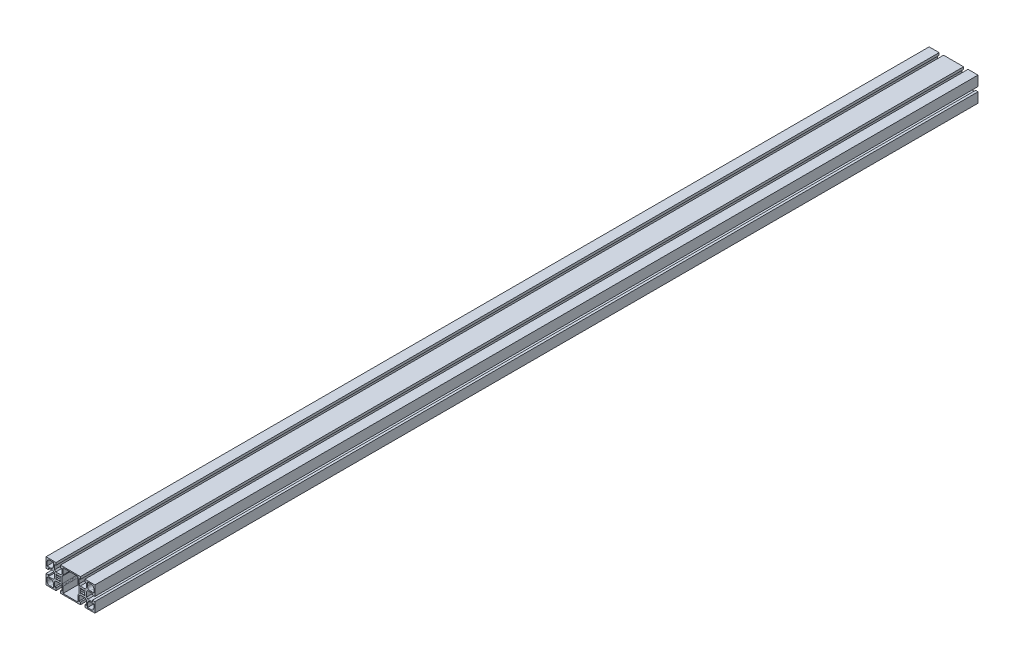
from build123d import *

# Parameters (mm, degrees)
EXTRUDE1_DEPTH      = 813.0032
EXTRUDE1_DEPTH_BACK = 813.0032


with BuildPart() as part:
    # Sketch1 → Extrude1 (new, two sides: drawn at the far end of the back side and taken through both)
    with BuildSketch(Plane.XY.offset(-EXTRUDE1_DEPTH_BACK)):
        Polygon((40.5, 4.1), (45, 4.1), (45, 22.5), (26.6, 22.5), (26.6, 18), (29.3, 18), (29.3, 9.5), (27, 7.2), (18, 7.2), (15.7, 9.5), (15.7, 18), (18.4, 18), (18.4, 22.5), (-18.4, 22.5), (-18.4, 18), (-15.7, 18), (-15.7, 9.5), (-18, 7.2), (-27, 7.2), (-29.3, 9.5), (-29.3, 18), (-26.6, 18), (-26.6, 22.5), (-45, 22.5), (-45, 4.1), (-40.5, 4.1), (-40.5, 6.8), (-32, 6.8), (-29.7, 4.5), (-29.7, -4.5), (-32, -6.8), (-40.5, -6.8), (-40.5, -4.1), (-45, -4.1), (-45, -22.5), (-26.6, -22.5), (-26.6, -18), (-29.3, -18), (-29.3, -9.5), (-27, -7.2), (-18, -7.2), (-15.7, -9.5), (-15.7, -18), (-18.4, -18), (-18.4, -22.5), (18.4, -22.5), (18.4, -18), (15.7, -18), (15.7, -9.5), (18, -7.2), (27, -7.2), (29.3, -9.5), (29.3, -18), (26.6, -18), (26.6, -22.5), (45, -22.5), (45, -4.1), (40.5, -4.1), (40.5, -6.8), (32, -6.8), (29.7, -4.5), (29.7, 4.5), (32, 6.8), (40.5, 6.8), align=None)
        with BuildLine():
            Line((-43, 8.799987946), (-43, 15.5))
            ThreePointArc((-43, 15.5), (-41.535533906, 19.035533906), (-38, 20.5))
            Line((-38, 20.5), (-31.30001823, 20.5))
            Line((-31.30001823, 20.5), (-31.300018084, 13.799988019))
            ThreePointArc((-31.300018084, 13.799988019), (-32.764484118, 10.264454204), (-36.300017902, 8.799988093))
            Line((-36.300017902, 8.799988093), (-43, 8.799987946))
        make_face(mode=Mode.SUBTRACT)
        with BuildLine():
            Line((-43, -15.5), (-43, -8.7999878))
            Line((-43, -8.7999878), (-36.300017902, -8.799987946))
            ThreePointArc((-36.300017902, -8.799987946), (-32.764483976, -10.264454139), (-31.300017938, -13.799988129))
            Line((-31.300017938, -13.799988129), (-31.300018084, -20.5))
            Line((-31.300018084, -20.5), (-38, -20.5))
            ThreePointArc((-38, -20.5), (-41.535533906, -19.035533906), (-43, -15.5))
        make_face(mode=Mode.SUBTRACT)
        with BuildLine():
            Line((31.300018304, -20.5), (31.300018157, -13.799988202))
            ThreePointArc((31.300018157, -13.799988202), (32.764484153, -10.264454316), (36.300017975, -8.799988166))
            Line((36.300017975, -8.799988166), (43, -8.799988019))
            Line((43, -8.799988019), (43, -15.5))
            ThreePointArc((43, -15.5), (41.535533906, -19.035533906), (38, -20.5))
            Line((38, -20.5), (31.300018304, -20.5))
        make_face(mode=Mode.SUBTRACT)
        with BuildLine():
            Line((31.300018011, 13.799988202), (31.300018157, 20.5))
            Line((31.300018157, 20.5), (38, 20.5))
            ThreePointArc((38, 20.5), (41.535533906, 19.035533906), (43, 15.5))
            Line((43, 15.5), (43, 8.799987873))
            Line((43, 8.799987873), (36.300017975, 8.799988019))
            ThreePointArc((36.300017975, 8.799988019), (32.764484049, 10.264454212), (31.300018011, 13.799988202))
        make_face(mode=Mode.SUBTRACT)
        with BuildLine():
            Line((-25.681980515, 4.596194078), (-24.348524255, 3.262737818))
            ThreePointArc((-24.348524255, 3.262737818), (-22.5, 3.749999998), (-20.651475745, 3.262737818))
            Line((-20.651475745, 3.262737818), (-19.318019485, 4.596194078))
            Line((-19.318019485, 4.596194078), (-17.903805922, 3.181980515))
            Line((-17.903805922, 3.181980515), (-19.237262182, 1.848524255))
            ThreePointArc((-19.237262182, 1.848524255), (-18.750000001, 0), (-19.237262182, -1.848524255))
            Line((-19.237262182, -1.848524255), (-17.903805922, -3.181980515))
            Line((-17.903805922, -3.181980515), (-19.318019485, -4.596194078))
            Line((-19.318019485, -4.596194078), (-20.651475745, -3.262737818))
            ThreePointArc((-20.651475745, -3.262737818), (-22.5, -3.749999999), (-24.348524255, -3.262737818))
            Line((-24.348524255, -3.262737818), (-25.681980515, -4.596194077))
            Line((-25.681980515, -4.596194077), (-27.096194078, -3.181980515))
            Line((-27.096194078, -3.181980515), (-25.762737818, -1.848524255))
            ThreePointArc((-25.762737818, -1.848524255), (-26.249999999, 0), (-25.762737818, 1.848524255))
            Line((-25.762737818, 1.848524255), (-27.096194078, 3.181980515))
            Line((-27.096194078, 3.181980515), (-25.681980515, 4.596194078))
        make_face(mode=Mode.SUBTRACT)
        with BuildLine():
            Line((19.318019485, 4.596194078), (20.651475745, 3.262737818))
            ThreePointArc((20.651475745, 3.262737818), (22.5, 3.749999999), (24.348524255, 3.262737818))
            Line((24.348524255, 3.262737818), (25.681980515, 4.596194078))
            Line((25.681980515, 4.596194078), (27.096194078, 3.181980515))
            Line((27.096194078, 3.181980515), (25.762737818, 1.848524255))
            ThreePointArc((25.762737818, 1.848524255), (26.249999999, 0), (25.762737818, -1.848524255))
            Line((25.762737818, -1.848524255), (27.096194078, -3.181980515))
            Line((27.096194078, -3.181980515), (25.681980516, -4.596194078))
            Line((25.681980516, -4.596194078), (24.348524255, -3.262737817))
            ThreePointArc((24.348524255, -3.262737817), (22.5, -3.749999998), (20.651475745, -3.262737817))
            Line((20.651475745, -3.262737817), (19.318019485, -4.596194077))
            Line((19.318019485, -4.596194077), (17.903805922, -3.181980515))
            Line((17.903805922, -3.181980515), (19.237262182, -1.848524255))
            ThreePointArc((19.237262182, -1.848524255), (18.750000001, 0), (19.237262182, 1.848524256))
            Line((19.237262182, 1.848524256), (17.903805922, 3.181980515))
            Line((17.903805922, 3.181980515), (19.318019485, 4.596194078))
        make_face(mode=Mode.SUBTRACT)
        with BuildLine():
            Line((-14.285798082, -7.785798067), (-14.914213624, -7.15738247))
            ThreePointArc((-14.914213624, -7.15738247), (-15.347759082, -6.508535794), (-15.5, -5.74316897))
            Line((-15.5, -5.74316897), (-15.5, 5.74316897))
            ThreePointArc((-15.5, 5.74316897), (-15.347759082, 6.508535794), (-14.914213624, 7.15738247))
            Line((-14.914213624, 7.15738247), (-14.285798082, 7.785798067))
            ThreePointArc((-14.285798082, 7.785798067), (-13.852252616, 8.434644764), (-13.700011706, 9.200011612))
            Line((-13.700011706, 9.200011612), (-13.700011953, 20.5))
            Line((-13.700011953, 20.5), (13.7000122, 20.5))
            Line((13.7000122, 20.5), (13.700011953, 9.200011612))
            ThreePointArc((13.700011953, 9.200011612), (13.852252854, 8.434644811), (14.285798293, 7.785798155))
            Line((14.285798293, 7.785798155), (14.914213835, 7.157382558))
            ThreePointArc((14.914213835, 7.157382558), (15.347759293, 6.508535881), (15.500000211, 5.743169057))
            Line((15.500000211, 5.743169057), (15.500000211, -5.743168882))
            ThreePointArc((15.500000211, -5.743168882), (15.347759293, -6.508535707), (14.914213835, -7.157382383))
            Line((14.914213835, -7.157382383), (14.285798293, -7.78579798))
            ThreePointArc((14.285798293, -7.78579798), (13.852252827, -8.434644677), (13.700011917, -9.200011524))
            Line((13.700011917, -9.200011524), (13.700012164, -20.499999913))
            Line((13.700012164, -20.499999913), (-13.700011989, -20.499999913))
            Line((-13.700011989, -20.499999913), (-13.700011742, -9.200011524))
            ThreePointArc((-13.700011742, -9.200011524), (-13.852252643, -8.434644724), (-14.285798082, -7.785798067))
        make_face(mode=Mode.SUBTRACT)
    extrude(amount=EXTRUDE1_DEPTH + EXTRUDE1_DEPTH_BACK)


solid = part.part
